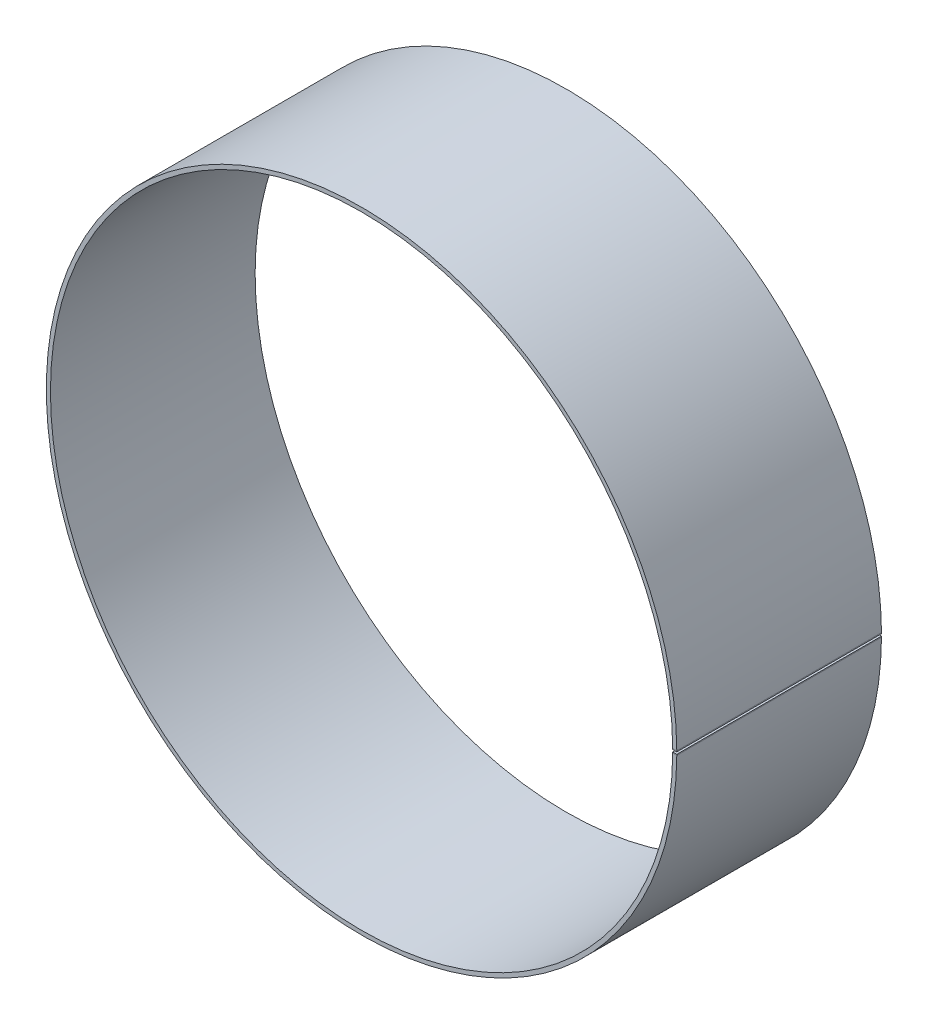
ISO-10303-21;
HEADER;
FILE_DESCRIPTION(('STEP AP214'),'2;1');
FILE_NAME('part.step','',(''),(''),'','','');
FILE_SCHEMA(('AUTOMOTIVE_DESIGN { 1 0 10303 214 1 1 1 1 }'));
ENDSEC;
DATA;
#1=APPLICATION_CONTEXT('core data for automotive mechanical design processes');
#2=APPLICATION_PROTOCOL_DEFINITION('international standard','automotive_design',2000,#1);
#3=PRODUCT_CONTEXT('',#1,'mechanical');
#4=PRODUCT('Part','Part','',(#3));
#5=PRODUCT_RELATED_PRODUCT_CATEGORY('part','',(#4));
#6=PRODUCT_DEFINITION_FORMATION('','',#4);
#7=PRODUCT_DEFINITION_CONTEXT('part definition',#1,'design');
#8=PRODUCT_DEFINITION('design','',#6,#7);
#9=PRODUCT_DEFINITION_SHAPE('','',#8);
#10=(LENGTH_UNIT() NAMED_UNIT(*) SI_UNIT(.MILLI.,.METRE.));
#11=(NAMED_UNIT(*) PLANE_ANGLE_UNIT() SI_UNIT($,.RADIAN.));
#12=(NAMED_UNIT(*) SI_UNIT($,.STERADIAN.) SOLID_ANGLE_UNIT());
#13=UNCERTAINTY_MEASURE_WITH_UNIT(LENGTH_MEASURE(1.E-05),#10,'distance_accuracy_value','');
#14=(GEOMETRIC_REPRESENTATION_CONTEXT(3) GLOBAL_UNCERTAINTY_ASSIGNED_CONTEXT((#13)) GLOBAL_UNIT_ASSIGNED_CONTEXT((#10,
#11,#12)) REPRESENTATION_CONTEXT('',''));
#15=CARTESIAN_POINT('',(0.,0.,0.));
#16=DIRECTION('',(0.,0.,1.));
#17=DIRECTION('',(1.,0.,0.));
#18=AXIS2_PLACEMENT_3D('',#15,#16,#17);
#19=CARTESIAN_POINT('',(0.,0.,99.9999999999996));
#20=DIRECTION('',(0.,0.,1.));
#21=DIRECTION('',(0.999978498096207,0.00655769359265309,0.));
#22=AXIS2_PLACEMENT_3D('',#19,#20,#21);
#23=PLANE('',#22);
#24=DIRECTION('',(-0.999978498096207,0.00655769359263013,0.));
#25=VECTOR('',#24,1.);
#26=CARTESIAN_POINT('',(153.996688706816,-1.00988481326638,100.));
#27=LINE('',#26,#25);
#28=CARTESIAN_POINT('',(153.996688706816,-1.00988481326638,100.));
#29=VERTEX_POINT('',#28);
#30=CARTESIAN_POINT('',(151.996731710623,-0.996769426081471,100.));
#31=VERTEX_POINT('',#30);
#32=EDGE_CURVE('E149',#29,#31,#27,.T.);
#33=ORIENTED_EDGE('',*,*,#32,.T.);
#34=CARTESIAN_POINT('',(0.,0.,99.9999999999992));
#35=DIRECTION('',(0.,0.,1.));
#36=DIRECTION('',(0.999978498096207,0.00655769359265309,0.));
#37=AXIS2_PLACEMENT_3D('',#34,#35,#36);
#38=CIRCLE('',#37,152.);
#39=CARTESIAN_POINT('',(151.996731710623,0.996769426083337,99.9999999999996));
#40=VERTEX_POINT('',#39);
#41=EDGE_CURVE('E163',#31,#40,#38,.F.);
#42=ORIENTED_EDGE('',*,*,#41,.T.);
#43=DIRECTION('',(0.999978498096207,0.00655769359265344,0.));
#44=VECTOR('',#43,1.);
#45=CARTESIAN_POINT('',(151.996731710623,0.996769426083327,100.));
#46=LINE('',#45,#44);
#47=CARTESIAN_POINT('',(153.996688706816,1.00988481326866,99.9999999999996));
#48=VERTEX_POINT('',#47);
#49=EDGE_CURVE('E132',#40,#48,#46,.T.);
#50=ORIENTED_EDGE('',*,*,#49,.T.);
#51=CARTESIAN_POINT('',(0.,0.,99.9999999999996));
#52=DIRECTION('',(0.,0.,-1.));
#53=DIRECTION('',(-0.999978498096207,-0.00655769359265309,0.));
#54=AXIS2_PLACEMENT_3D('',#51,#52,#53);
#55=CIRCLE('',#54,154.);
#56=EDGE_CURVE('E153',#29,#48,#55,.T.);
#57=ORIENTED_EDGE('',*,*,#56,.F.);
#58=EDGE_LOOP('',(#33,#42,#50,#57));
#59=FACE_BOUND('',#58,.T.);
#60=ADVANCED_FACE('F39',(#59),#23,.T.);
#61=CARTESIAN_POINT('',(0.,0.,-2.22044604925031E-13));
#62=DIRECTION('',(0.,0.,-1.));
#63=DIRECTION('',(-0.00655769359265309,0.999978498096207,0.));
#64=AXIS2_PLACEMENT_3D('',#61,#62,#63);
#65=PLANE('',#64);
#66=DIRECTION('',(-0.999978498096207,-0.00655769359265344,0.));
#67=VECTOR('',#66,1.);
#68=CARTESIAN_POINT('',(153.996688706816,1.00988481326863,0.));
#69=LINE('',#68,#67);
#70=CARTESIAN_POINT('',(153.996688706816,1.00988481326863,0.));
#71=VERTEX_POINT('',#70);
#72=CARTESIAN_POINT('',(151.996731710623,0.996769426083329,0.));
#73=VERTEX_POINT('',#72);
#74=EDGE_CURVE('E11',#71,#73,#69,.T.);
#75=ORIENTED_EDGE('',*,*,#74,.T.);
#76=CARTESIAN_POINT('',(0.,0.,-4.44089209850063E-13));
#77=DIRECTION('',(0.,0.,1.));
#78=DIRECTION('',(0.999978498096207,0.00655769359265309,0.));
#79=AXIS2_PLACEMENT_3D('',#76,#77,#78);
#80=CIRCLE('',#79,152.);
#81=CARTESIAN_POINT('',(151.996731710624,-0.996769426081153,-2.22044597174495E-13));
#82=VERTEX_POINT('',#81);
#83=EDGE_CURVE('E159',#73,#82,#80,.T.);
#84=ORIENTED_EDGE('',*,*,#83,.T.);
#85=DIRECTION('',(0.999978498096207,-0.00655769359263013,0.));
#86=VECTOR('',#85,1.);
#87=CARTESIAN_POINT('',(151.996731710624,-0.996769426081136,0.));
#88=LINE('',#87,#86);
#89=CARTESIAN_POINT('',(153.996688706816,-1.00988481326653,-2.22044604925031E-13));
#90=VERTEX_POINT('',#89);
#91=EDGE_CURVE('E170',#82,#90,#88,.T.);
#92=ORIENTED_EDGE('',*,*,#91,.T.);
#93=CARTESIAN_POINT('',(0.,0.,-2.22044604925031E-13));
#94=DIRECTION('',(0.,0.,1.));
#95=DIRECTION('',(0.00655769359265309,-0.999978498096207,0.));
#96=AXIS2_PLACEMENT_3D('',#93,#94,#95);
#97=CIRCLE('',#96,154.);
#98=EDGE_CURVE('E158',#71,#90,#97,.T.);
#99=ORIENTED_EDGE('',*,*,#98,.F.);
#100=EDGE_LOOP('',(#75,#84,#92,#99));
#101=FACE_BOUND('',#100,.T.);
#102=ADVANCED_FACE('F259',(#101),#65,.T.);
#103=CARTESIAN_POINT('',(0.,0.,-914.520696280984));
#104=DIRECTION('',(0.,0.,1.));
#105=DIRECTION('',(0.999978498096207,0.00655769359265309,0.));
#106=AXIS2_PLACEMENT_3D('',#103,#104,#105);
#107=CYLINDRICAL_SURFACE('',#106,154.);
#108=ORIENTED_EDGE('',*,*,#98,.T.);
#109=DIRECTION('',(0.,0.,-1.));
#110=VECTOR('',#109,1.);
#111=CARTESIAN_POINT('',(153.996688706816,-1.00988481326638,100.));
#112=LINE('',#111,#110);
#113=EDGE_CURVE('E155',#29,#90,#112,.T.);
#114=ORIENTED_EDGE('',*,*,#113,.F.);
#115=ORIENTED_EDGE('',*,*,#56,.T.);
#116=DIRECTION('',(0.,0.,-1.));
#117=VECTOR('',#116,1.);
#118=CARTESIAN_POINT('',(153.996688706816,1.00988481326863,100.));
#119=LINE('',#118,#117);
#120=EDGE_CURVE('E142',#48,#71,#119,.T.);
#121=ORIENTED_EDGE('',*,*,#120,.T.);
#122=EDGE_LOOP('',(#108,#114,#115,#121));
#123=FACE_BOUND('',#122,.T.);
#124=ADVANCED_FACE('F154',(#123),#107,.T.);
#125=CARTESIAN_POINT('',(0.,0.,-914.520696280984));
#126=DIRECTION('',(0.,0.,1.));
#127=DIRECTION('',(0.999978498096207,0.00655769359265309,0.));
#128=AXIS2_PLACEMENT_3D('',#125,#126,#127);
#129=CYLINDRICAL_SURFACE('',#128,152.);
#130=ORIENTED_EDGE('',*,*,#83,.F.);
#131=DIRECTION('',(0.,0.,-1.));
#132=VECTOR('',#131,1.);
#133=CARTESIAN_POINT('',(151.996731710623,0.996769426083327,100.));
#134=LINE('',#133,#132);
#135=EDGE_CURVE('E46',#40,#73,#134,.T.);
#136=ORIENTED_EDGE('',*,*,#135,.F.);
#137=ORIENTED_EDGE('',*,*,#41,.F.);
#138=DIRECTION('',(0.,0.,-1.));
#139=VECTOR('',#138,1.);
#140=CARTESIAN_POINT('',(151.996731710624,-0.996769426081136,100.));
#141=LINE('',#140,#139);
#142=EDGE_CURVE('E167',#31,#82,#141,.T.);
#143=ORIENTED_EDGE('',*,*,#142,.T.);
#144=EDGE_LOOP('',(#130,#136,#137,#143));
#145=FACE_BOUND('',#144,.T.);
#146=ADVANCED_FACE('F257',(#145),#129,.F.);
#147=CARTESIAN_POINT('',(150.996753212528,-0.990211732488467,100.));
#148=DIRECTION('',(0.,0.,1.));
#149=DIRECTION('',(0.999978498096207,0.00655769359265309,0.));
#150=AXIS2_PLACEMENT_3D('',#147,#148,#149);
#151=PLANE('',#150);
#152=DIRECTION('',(1.,0.,0.));
#153=VECTOR('',#152,1.);
#154=CARTESIAN_POINT('',(151.996753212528,-0.990211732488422,100.));
#155=LINE('',#154,#153);
#156=CARTESIAN_POINT('',(151.996753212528,-0.990211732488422,100.));
#157=VERTEX_POINT('',#156);
#158=CARTESIAN_POINT('',(153.996753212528,-0.990211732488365,100.));
#159=VERTEX_POINT('',#158);
#160=EDGE_CURVE('E181',#157,#159,#155,.T.);
#161=ORIENTED_EDGE('',*,*,#160,.F.);
#162=CARTESIAN_POINT('',(150.996753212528,-0.990211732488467,100.));
#163=DIRECTION('',(0.,0.,1.));
#164=DIRECTION('',(0.00655769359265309,-0.999978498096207,0.));
#165=AXIS2_PLACEMENT_3D('',#162,#163,#164);
#166=CIRCLE('',#165,1.);
#167=EDGE_CURVE('E60',#157,#31,#166,.F.);
#168=ORIENTED_EDGE('',*,*,#167,.T.);
#169=ORIENTED_EDGE('',*,*,#32,.F.);
#170=CARTESIAN_POINT('',(150.996753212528,-0.990211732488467,100.));
#171=DIRECTION('',(0.,0.,-1.));
#172=DIRECTION('',(-0.999978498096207,-0.00655769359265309,0.));
#173=AXIS2_PLACEMENT_3D('',#170,#171,#172);
#174=CIRCLE('',#173,3.);
#175=EDGE_CURVE('E184',#159,#29,#174,.T.);
#176=ORIENTED_EDGE('',*,*,#175,.F.);
#177=EDGE_LOOP('',(#161,#168,#169,#176));
#178=FACE_BOUND('',#177,.T.);
#179=ADVANCED_FACE('F274',(#178),#151,.T.);
#180=CARTESIAN_POINT('',(150.996753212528,-0.990211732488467,-2.21774281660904E-13));
#181=DIRECTION('',(0.,1.41079983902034E-11,-1.));
#182=DIRECTION('',(-0.00655769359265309,0.999978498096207,1.41070889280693E-11));
#183=AXIS2_PLACEMENT_3D('',#180,#181,#182);
#184=PLANE('',#183);
#185=ORIENTED_EDGE('',*,*,#91,.F.);
#186=CARTESIAN_POINT('',(150.996753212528,-0.990211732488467,-2.21774281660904E-13));
#187=DIRECTION('',(0.,-1.41079983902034E-11,1.));
#188=DIRECTION('',(0.00655769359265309,-0.999978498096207,-1.41070889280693E-11));
#189=AXIS2_PLACEMENT_3D('',#186,#187,#188);
#190=CIRCLE('',#189,1.);
#191=CARTESIAN_POINT('',(151.996753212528,-0.990211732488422,0.));
#192=VERTEX_POINT('',#191);
#193=EDGE_CURVE('E180',#82,#192,#190,.T.);
#194=ORIENTED_EDGE('',*,*,#193,.T.);
#195=DIRECTION('',(-1.,0.,0.));
#196=VECTOR('',#195,1.);
#197=CARTESIAN_POINT('',(153.996753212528,-0.990211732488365,0.));
#198=LINE('',#197,#196);
#199=CARTESIAN_POINT('',(153.996753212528,-0.990211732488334,0.));
#200=VERTEX_POINT('',#199);
#201=EDGE_CURVE('E205',#200,#192,#198,.T.);
#202=ORIENTED_EDGE('',*,*,#201,.F.);
#203=CARTESIAN_POINT('',(150.996753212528,-0.990211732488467,-2.21774281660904E-13));
#204=DIRECTION('',(0.,-1.41079983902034E-11,1.));
#205=DIRECTION('',(0.00655769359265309,-0.999978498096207,-1.41070889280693E-11));
#206=AXIS2_PLACEMENT_3D('',#203,#204,#205);
#207=CIRCLE('',#206,3.);
#208=EDGE_CURVE('E175',#90,#200,#207,.T.);
#209=ORIENTED_EDGE('',*,*,#208,.F.);
#210=EDGE_LOOP('',(#185,#194,#202,#209));
#211=FACE_BOUND('',#210,.T.);
#212=ADVANCED_FACE('F263',(#211),#184,.T.);
#213=CARTESIAN_POINT('',(150.996753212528,-0.990211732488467,-50.0200057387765));
#214=DIRECTION('',(0.,0.,1.));
#215=DIRECTION('',(0.00655769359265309,-0.999978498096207,0.));
#216=AXIS2_PLACEMENT_3D('',#213,#214,#215);
#217=CYLINDRICAL_SURFACE('',#216,3.);
#218=ORIENTED_EDGE('',*,*,#208,.T.);
#219=DIRECTION('',(0.,0.,-1.));
#220=VECTOR('',#219,1.);
#221=CARTESIAN_POINT('',(153.996753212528,-0.990211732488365,100.));
#222=LINE('',#221,#220);
#223=EDGE_CURVE('E200',#159,#200,#222,.T.);
#224=ORIENTED_EDGE('',*,*,#223,.F.);
#225=ORIENTED_EDGE('',*,*,#175,.T.);
#226=ORIENTED_EDGE('',*,*,#113,.T.);
#227=EDGE_LOOP('',(#218,#224,#225,#226));
#228=FACE_BOUND('',#227,.T.);
#229=ADVANCED_FACE('F286',(#228),#217,.T.);
#230=CARTESIAN_POINT('',(150.996753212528,-0.990211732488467,-50.0200057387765));
#231=DIRECTION('',(0.,0.,1.));
#232=DIRECTION('',(0.00655769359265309,-0.999978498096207,0.));
#233=AXIS2_PLACEMENT_3D('',#230,#231,#232);
#234=CYLINDRICAL_SURFACE('',#233,1.);
#235=ORIENTED_EDGE('',*,*,#193,.F.);
#236=ORIENTED_EDGE('',*,*,#142,.F.);
#237=ORIENTED_EDGE('',*,*,#167,.F.);
#238=DIRECTION('',(0.,0.,-1.));
#239=VECTOR('',#238,1.);
#240=CARTESIAN_POINT('',(151.996753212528,-0.990211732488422,100.));
#241=LINE('',#240,#239);
#242=EDGE_CURVE('E189',#157,#192,#241,.T.);
#243=ORIENTED_EDGE('',*,*,#242,.T.);
#244=EDGE_LOOP('',(#235,#236,#237,#243));
#245=FACE_BOUND('',#244,.T.);
#246=ADVANCED_FACE('F266',(#245),#234,.F.);
#247=CARTESIAN_POINT('',(151.996753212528,-0.499999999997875,100.));
#248=DIRECTION('',(0.,1.,0.));
#249=DIRECTION('',(0.,0.,1.));
#250=AXIS2_PLACEMENT_3D('',#247,#248,#249);
#251=PLANE('',#250);
#252=DIRECTION('',(1.,0.,0.));
#253=VECTOR('',#252,1.);
#254=CARTESIAN_POINT('',(151.996753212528,-0.499999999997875,0.));
#255=LINE('',#254,#253);
#256=CARTESIAN_POINT('',(151.996753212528,-0.499999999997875,0.));
#257=VERTEX_POINT('',#256);
#258=CARTESIAN_POINT('',(153.996753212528,-0.499999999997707,0.));
#259=VERTEX_POINT('',#258);
#260=EDGE_CURVE('E208',#257,#259,#255,.T.);
#261=ORIENTED_EDGE('',*,*,#260,.F.);
#262=DIRECTION('',(0.,0.,-1.));
#263=VECTOR('',#262,1.);
#264=CARTESIAN_POINT('',(151.996753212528,-0.499999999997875,100.));
#265=LINE('',#264,#263);
#266=CARTESIAN_POINT('',(151.996753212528,-0.499999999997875,100.));
#267=VERTEX_POINT('',#266);
#268=EDGE_CURVE('E213',#267,#257,#265,.T.);
#269=ORIENTED_EDGE('',*,*,#268,.F.);
#270=DIRECTION('',(1.,0.,0.));
#271=VECTOR('',#270,1.);
#272=CARTESIAN_POINT('',(151.996753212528,-0.499999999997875,100.));
#273=LINE('',#272,#271);
#274=CARTESIAN_POINT('',(153.996753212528,-0.499999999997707,100.));
#275=VERTEX_POINT('',#274);
#276=EDGE_CURVE('E192',#267,#275,#273,.T.);
#277=ORIENTED_EDGE('',*,*,#276,.T.);
#278=DIRECTION('',(0.,0.,-1.));
#279=VECTOR('',#278,1.);
#280=CARTESIAN_POINT('',(153.996753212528,-0.499999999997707,100.));
#281=LINE('',#280,#279);
#282=EDGE_CURVE('E196',#275,#259,#281,.T.);
#283=ORIENTED_EDGE('',*,*,#282,.T.);
#284=EDGE_LOOP('',(#261,#269,#277,#283));
#285=FACE_BOUND('',#284,.T.);
#286=ADVANCED_FACE('F281',(#285),#251,.T.);
#287=CARTESIAN_POINT('',(153.996753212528,-0.999999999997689,100.));
#288=DIRECTION('',(1.,0.,0.));
#289=DIRECTION('',(0.,0.,-1.));
#290=AXIS2_PLACEMENT_3D('',#287,#288,#289);
#291=PLANE('',#290);
#292=DIRECTION('',(0.,-1.,0.));
#293=VECTOR('',#292,1.);
#294=CARTESIAN_POINT('',(153.996753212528,-0.999999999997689,0.));
#295=LINE('',#294,#293);
#296=EDGE_CURVE('E203',#259,#200,#295,.T.);
#297=ORIENTED_EDGE('',*,*,#296,.F.);
#298=ORIENTED_EDGE('',*,*,#282,.F.);
#299=DIRECTION('',(0.,-1.,0.));
#300=VECTOR('',#299,1.);
#301=CARTESIAN_POINT('',(153.996753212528,-0.999999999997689,100.));
#302=LINE('',#301,#300);
#303=EDGE_CURVE('E198',#275,#159,#302,.T.);
#304=ORIENTED_EDGE('',*,*,#303,.T.);
#305=ORIENTED_EDGE('',*,*,#223,.T.);
#306=EDGE_LOOP('',(#297,#298,#304,#305));
#307=FACE_BOUND('',#306,.T.);
#308=ADVANCED_FACE('F288',(#307),#291,.T.);
#309=CARTESIAN_POINT('',(151.996731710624,-0.996769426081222,0.));
#310=DIRECTION('',(0.,0.,-1.));
#311=DIRECTION('',(-1.,0.,0.));
#312=AXIS2_PLACEMENT_3D('',#309,#310,#311);
#313=PLANE('',#312);
#314=ORIENTED_EDGE('',*,*,#296,.T.);
#315=ORIENTED_EDGE('',*,*,#201,.T.);
#316=DIRECTION('',(0.,1.,0.));
#317=VECTOR('',#316,1.);
#318=CARTESIAN_POINT('',(151.996753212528,-0.999999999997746,0.));
#319=LINE('',#318,#317);
#320=EDGE_CURVE('E211',#257,#192,#319,.F.);
#321=ORIENTED_EDGE('',*,*,#320,.F.);
#322=ORIENTED_EDGE('',*,*,#260,.T.);
#323=EDGE_LOOP('',(#314,#315,#321,#322));
#324=FACE_BOUND('',#323,.T.);
#325=ADVANCED_FACE('F284',(#324),#313,.T.);
#326=CARTESIAN_POINT('',(151.996753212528,-0.999999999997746,100.));
#327=DIRECTION('',(1.,0.,0.));
#328=DIRECTION('',(0.,0.,-1.));
#329=AXIS2_PLACEMENT_3D('',#326,#327,#328);
#330=PLANE('',#329);
#331=ORIENTED_EDGE('',*,*,#320,.T.);
#332=ORIENTED_EDGE('',*,*,#242,.F.);
#333=DIRECTION('',(0.,1.,0.));
#334=VECTOR('',#333,1.);
#335=CARTESIAN_POINT('',(151.996753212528,-0.999999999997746,100.));
#336=LINE('',#335,#334);
#337=EDGE_CURVE('E215',#267,#157,#336,.F.);
#338=ORIENTED_EDGE('',*,*,#337,.F.);
#339=ORIENTED_EDGE('',*,*,#268,.T.);
#340=EDGE_LOOP('',(#331,#332,#338,#339));
#341=FACE_BOUND('',#340,.T.);
#342=ADVANCED_FACE('F270',(#341),#330,.F.);
#343=CARTESIAN_POINT('',(150.996753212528,0.990211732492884,100.));
#344=DIRECTION('',(0.,0.,-1.));
#345=DIRECTION('',(-1.,0.,0.));
#346=AXIS2_PLACEMENT_3D('',#343,#344,#345);
#347=PLANE('',#346);
#348=ORIENTED_EDGE('',*,*,#337,.T.);
#349=ORIENTED_EDGE('',*,*,#160,.T.);
#350=ORIENTED_EDGE('',*,*,#303,.F.);
#351=ORIENTED_EDGE('',*,*,#276,.F.);
#352=EDGE_LOOP('',(#348,#349,#350,#351));
#353=FACE_BOUND('',#352,.T.);
#354=ADVANCED_FACE('F278',(#353),#347,.F.);
#355=CARTESIAN_POINT('',(153.996753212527,0.5,100.));
#356=DIRECTION('',(0.,-1.,0.));
#357=DIRECTION('',(0.,0.,-1.));
#358=AXIS2_PLACEMENT_3D('',#355,#356,#357);
#359=PLANE('',#358);
#360=DIRECTION('',(-1.,0.,0.));
#361=VECTOR('',#360,1.);
#362=CARTESIAN_POINT('',(153.996753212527,0.5,0.));
#363=LINE('',#362,#361);
#364=CARTESIAN_POINT('',(153.996753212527,0.5,0.));
#365=VERTEX_POINT('',#364);
#366=CARTESIAN_POINT('',(151.996753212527,0.5,0.));
#367=VERTEX_POINT('',#366);
#368=EDGE_CURVE('E193',#365,#367,#363,.T.);
#369=ORIENTED_EDGE('',*,*,#368,.F.);
#370=DIRECTION('',(0.,0.,-1.));
#371=VECTOR('',#370,1.);
#372=CARTESIAN_POINT('',(153.996753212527,0.5,100.));
#373=LINE('',#372,#371);
#374=CARTESIAN_POINT('',(153.996753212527,0.5,100.));
#375=VERTEX_POINT('',#374);
#376=EDGE_CURVE('E229',#375,#365,#373,.T.);
#377=ORIENTED_EDGE('',*,*,#376,.F.);
#378=DIRECTION('',(-1.,0.,0.));
#379=VECTOR('',#378,1.);
#380=CARTESIAN_POINT('',(153.996753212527,0.5,100.));
#381=LINE('',#380,#379);
#382=CARTESIAN_POINT('',(151.996753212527,0.5,100.));
#383=VERTEX_POINT('',#382);
#384=EDGE_CURVE('E221',#375,#383,#381,.T.);
#385=ORIENTED_EDGE('',*,*,#384,.T.);
#386=DIRECTION('',(0.,0.,-1.));
#387=VECTOR('',#386,1.);
#388=CARTESIAN_POINT('',(151.996753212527,0.5,100.));
#389=LINE('',#388,#387);
#390=EDGE_CURVE('E224',#383,#367,#389,.T.);
#391=ORIENTED_EDGE('',*,*,#390,.T.);
#392=EDGE_LOOP('',(#369,#377,#385,#391));
#393=FACE_BOUND('',#392,.T.);
#394=ADVANCED_FACE('F318',(#393),#359,.T.);
#395=CARTESIAN_POINT('',(153.996753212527,1.,100.));
#396=DIRECTION('',(1.,0.,0.));
#397=DIRECTION('',(0.,0.,-1.));
#398=AXIS2_PLACEMENT_3D('',#395,#396,#397);
#399=PLANE('',#398);
#400=DIRECTION('',(0.,-1.,0.));
#401=VECTOR('',#400,1.);
#402=CARTESIAN_POINT('',(153.996753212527,1.,0.));
#403=LINE('',#402,#401);
#404=CARTESIAN_POINT('',(153.996753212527,0.990211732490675,0.));
#405=VERTEX_POINT('',#404);
#406=EDGE_CURVE('E243',#405,#365,#403,.T.);
#407=ORIENTED_EDGE('',*,*,#406,.F.);
#408=DIRECTION('',(0.,0.,-1.));
#409=VECTOR('',#408,1.);
#410=CARTESIAN_POINT('',(153.996753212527,0.990211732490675,100.));
#411=LINE('',#410,#409);
#412=CARTESIAN_POINT('',(153.996753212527,0.990211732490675,100.));
#413=VERTEX_POINT('',#412);
#414=EDGE_CURVE('E219',#413,#405,#411,.T.);
#415=ORIENTED_EDGE('',*,*,#414,.F.);
#416=DIRECTION('',(0.,-1.,0.));
#417=VECTOR('',#416,1.);
#418=CARTESIAN_POINT('',(153.996753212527,1.,100.));
#419=LINE('',#418,#417);
#420=EDGE_CURVE('E226',#413,#375,#419,.T.);
#421=ORIENTED_EDGE('',*,*,#420,.T.);
#422=ORIENTED_EDGE('',*,*,#376,.T.);
#423=EDGE_LOOP('',(#407,#415,#421,#422));
#424=FACE_BOUND('',#423,.T.);
#425=ADVANCED_FACE('F334',(#424),#399,.T.);
#426=CARTESIAN_POINT('',(151.996731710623,0.996769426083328,100.));
#427=DIRECTION('',(0.,0.,1.));
#428=DIRECTION('',(1.,0.,0.));
#429=AXIS2_PLACEMENT_3D('',#426,#427,#428);
#430=PLANE('',#429);
#431=ORIENTED_EDGE('',*,*,#420,.F.);
#432=DIRECTION('',(-1.,0.,0.));
#433=VECTOR('',#432,1.);
#434=CARTESIAN_POINT('',(153.996753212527,0.990211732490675,100.));
#435=LINE('',#434,#433);
#436=CARTESIAN_POINT('',(151.996753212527,0.990211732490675,100.));
#437=VERTEX_POINT('',#436);
#438=EDGE_CURVE('E134',#413,#437,#435,.T.);
#439=ORIENTED_EDGE('',*,*,#438,.T.);
#440=DIRECTION('',(0.,1.,0.));
#441=VECTOR('',#440,1.);
#442=CARTESIAN_POINT('',(151.996753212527,1.,100.));
#443=LINE('',#442,#441);
#444=EDGE_CURVE('E232',#437,#383,#443,.F.);
#445=ORIENTED_EDGE('',*,*,#444,.T.);
#446=ORIENTED_EDGE('',*,*,#384,.F.);
#447=EDGE_LOOP('',(#431,#439,#445,#446));
#448=FACE_BOUND('',#447,.T.);
#449=ADVANCED_FACE('F342',(#448),#430,.T.);
#450=CARTESIAN_POINT('',(151.996753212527,1.,100.));
#451=DIRECTION('',(1.,0.,0.));
#452=DIRECTION('',(0.,0.,-1.));
#453=AXIS2_PLACEMENT_3D('',#450,#451,#452);
#454=PLANE('',#453);
#455=DIRECTION('',(0.,1.,0.));
#456=VECTOR('',#455,1.);
#457=CARTESIAN_POINT('',(151.996753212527,1.,0.));
#458=LINE('',#457,#456);
#459=CARTESIAN_POINT('',(151.996753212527,0.990211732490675,0.));
#460=VERTEX_POINT('',#459);
#461=EDGE_CURVE('E234',#460,#367,#458,.F.);
#462=ORIENTED_EDGE('',*,*,#461,.T.);
#463=ORIENTED_EDGE('',*,*,#390,.F.);
#464=ORIENTED_EDGE('',*,*,#444,.F.);
#465=DIRECTION('',(0.,0.,-1.));
#466=VECTOR('',#465,1.);
#467=CARTESIAN_POINT('',(151.996753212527,0.990211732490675,100.));
#468=LINE('',#467,#466);
#469=EDGE_CURVE('E237',#437,#460,#468,.T.);
#470=ORIENTED_EDGE('',*,*,#469,.T.);
#471=EDGE_LOOP('',(#462,#463,#464,#470));
#472=FACE_BOUND('',#471,.T.);
#473=ADVANCED_FACE('F350',(#472),#454,.F.);
#474=CARTESIAN_POINT('',(150.996753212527,0.990211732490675,0.));
#475=DIRECTION('',(0.,0.,-1.));
#476=DIRECTION('',(-1.,0.,0.));
#477=AXIS2_PLACEMENT_3D('',#474,#475,#476);
#478=PLANE('',#477);
#479=ORIENTED_EDGE('',*,*,#461,.F.);
#480=DIRECTION('',(1.,0.,0.));
#481=VECTOR('',#480,1.);
#482=CARTESIAN_POINT('',(151.996753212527,0.990211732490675,0.));
#483=LINE('',#482,#481);
#484=EDGE_CURVE('E240',#460,#405,#483,.T.);
#485=ORIENTED_EDGE('',*,*,#484,.T.);
#486=ORIENTED_EDGE('',*,*,#406,.T.);
#487=ORIENTED_EDGE('',*,*,#368,.T.);
#488=EDGE_LOOP('',(#479,#485,#486,#487));
#489=FACE_BOUND('',#488,.T.);
#490=ADVANCED_FACE('F358',(#489),#478,.T.);
#491=CARTESIAN_POINT('',(150.996753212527,0.990211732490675,99.9999999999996));
#492=DIRECTION('',(-1.85035847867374E-13,2.8215997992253E-11,1.));
#493=DIRECTION('',(0.,-1.,2.8215997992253E-11));
#494=AXIS2_PLACEMENT_3D('',#491,#492,#493);
#495=PLANE('',#494);
#496=ORIENTED_EDGE('',*,*,#49,.F.);
#497=CARTESIAN_POINT('',(150.996753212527,0.990211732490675,99.9999999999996));
#498=DIRECTION('',(1.85035847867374E-13,-2.8215997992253E-11,-1.));
#499=DIRECTION('',(0.,1.,-2.8215997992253E-11));
#500=AXIS2_PLACEMENT_3D('',#497,#498,#499);
#501=CIRCLE('',#500,1.);
#502=EDGE_CURVE('E248',#40,#437,#501,.T.);
#503=ORIENTED_EDGE('',*,*,#502,.T.);
#504=ORIENTED_EDGE('',*,*,#438,.F.);
#505=CARTESIAN_POINT('',(150.996753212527,0.990211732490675,99.9999999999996));
#506=DIRECTION('',(1.85035847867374E-13,-2.8215997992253E-11,-1.));
#507=DIRECTION('',(0.,1.,-2.8215997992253E-11));
#508=AXIS2_PLACEMENT_3D('',#505,#506,#507);
#509=CIRCLE('',#508,3.);
#510=EDGE_CURVE('E128',#48,#413,#509,.T.);
#511=ORIENTED_EDGE('',*,*,#510,.F.);
#512=EDGE_LOOP('',(#496,#503,#504,#511));
#513=FACE_BOUND('',#512,.T.);
#514=ADVANCED_FACE('F130',(#513),#495,.T.);
#515=CARTESIAN_POINT('',(150.996753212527,0.990211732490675,0.));
#516=DIRECTION('',(0.,0.,-1.));
#517=DIRECTION('',(-1.,0.,0.));
#518=AXIS2_PLACEMENT_3D('',#515,#516,#517);
#519=PLANE('',#518);
#520=ORIENTED_EDGE('',*,*,#484,.F.);
#521=CARTESIAN_POINT('',(150.996753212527,0.990211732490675,0.));
#522=DIRECTION('',(0.,0.,1.));
#523=DIRECTION('',(1.,0.,0.));
#524=AXIS2_PLACEMENT_3D('',#521,#522,#523);
#525=CIRCLE('',#524,1.);
#526=EDGE_CURVE('E138',#460,#73,#525,.T.);
#527=ORIENTED_EDGE('',*,*,#526,.T.);
#528=ORIENTED_EDGE('',*,*,#74,.F.);
#529=CARTESIAN_POINT('',(150.996753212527,0.990211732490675,0.));
#530=DIRECTION('',(0.,0.,1.));
#531=DIRECTION('',(1.,0.,0.));
#532=AXIS2_PLACEMENT_3D('',#529,#530,#531);
#533=CIRCLE('',#532,3.);
#534=EDGE_CURVE('E137',#405,#71,#533,.T.);
#535=ORIENTED_EDGE('',*,*,#534,.F.);
#536=EDGE_LOOP('',(#520,#527,#528,#535));
#537=FACE_BOUND('',#536,.T.);
#538=ADVANCED_FACE('F253',(#537),#519,.T.);
#539=CARTESIAN_POINT('',(150.996753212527,0.990211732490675,-50.0199988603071));
#540=DIRECTION('',(0.,0.,1.));
#541=DIRECTION('',(1.,0.,0.));
#542=AXIS2_PLACEMENT_3D('',#539,#540,#541);
#543=CYLINDRICAL_SURFACE('',#542,3.);
#544=ORIENTED_EDGE('',*,*,#534,.T.);
#545=ORIENTED_EDGE('',*,*,#120,.F.);
#546=ORIENTED_EDGE('',*,*,#510,.T.);
#547=ORIENTED_EDGE('',*,*,#414,.T.);
#548=EDGE_LOOP('',(#544,#545,#546,#547));
#549=FACE_BOUND('',#548,.T.);
#550=ADVANCED_FACE('F144',(#549),#543,.T.);
#551=CARTESIAN_POINT('',(150.996753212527,0.990211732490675,-50.0199988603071));
#552=DIRECTION('',(0.,0.,1.));
#553=DIRECTION('',(1.,0.,0.));
#554=AXIS2_PLACEMENT_3D('',#551,#552,#553);
#555=CYLINDRICAL_SURFACE('',#554,1.);
#556=ORIENTED_EDGE('',*,*,#526,.F.);
#557=ORIENTED_EDGE('',*,*,#469,.F.);
#558=ORIENTED_EDGE('',*,*,#502,.F.);
#559=ORIENTED_EDGE('',*,*,#135,.T.);
#560=EDGE_LOOP('',(#556,#557,#558,#559));
#561=FACE_BOUND('',#560,.T.);
#562=ADVANCED_FACE('F385',(#561),#555,.F.);
#563=CLOSED_SHELL('',(#60,#102,#124,#146,#179,#212,#229,#246,#286,#308,#325,#342,#354,#394,#425,
#449,#473,#490,#514,#538,#550,#562));
#564=MANIFOLD_SOLID_BREP('B2',#563);
#565=ADVANCED_BREP_SHAPE_REPRESENTATION('',(#18,#564),#14);
#566=SHAPE_DEFINITION_REPRESENTATION(#9,#565);
ENDSEC;
END-ISO-10303-21;
